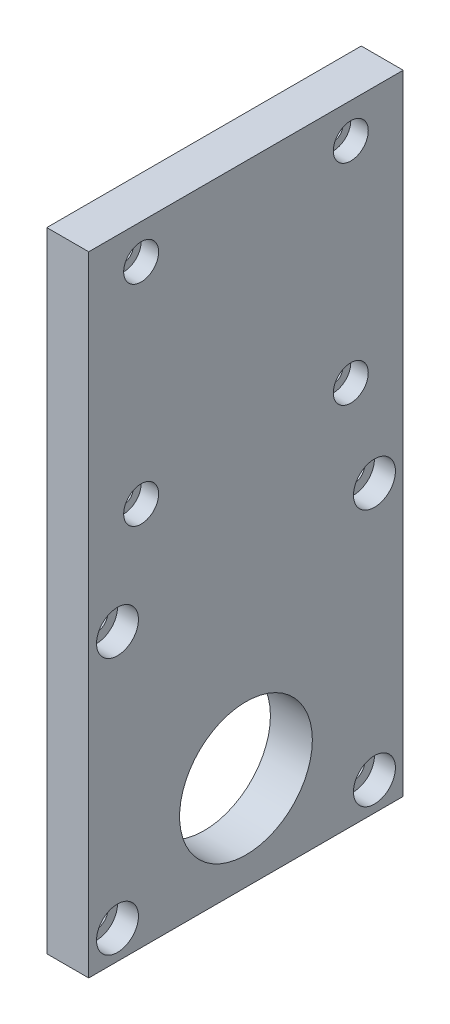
ISO-10303-21;
HEADER;
FILE_DESCRIPTION(('STEP AP214'),'2;1');
FILE_NAME('part.step','',(''),(''),'','','');
FILE_SCHEMA(('AUTOMOTIVE_DESIGN { 1 0 10303 214 1 1 1 1 }'));
ENDSEC;
DATA;
#1=APPLICATION_CONTEXT('core data for automotive mechanical design processes');
#2=APPLICATION_PROTOCOL_DEFINITION('international standard','automotive_design',2000,#1);
#3=PRODUCT_CONTEXT('',#1,'mechanical');
#4=PRODUCT('Part','Part','',(#3));
#5=PRODUCT_RELATED_PRODUCT_CATEGORY('part','',(#4));
#6=PRODUCT_DEFINITION_FORMATION('','',#4);
#7=PRODUCT_DEFINITION_CONTEXT('part definition',#1,'design');
#8=PRODUCT_DEFINITION('design','',#6,#7);
#9=PRODUCT_DEFINITION_SHAPE('','',#8);
#10=(LENGTH_UNIT() NAMED_UNIT(*) SI_UNIT(.MILLI.,.METRE.));
#11=(NAMED_UNIT(*) PLANE_ANGLE_UNIT() SI_UNIT($,.RADIAN.));
#12=(NAMED_UNIT(*) SI_UNIT($,.STERADIAN.) SOLID_ANGLE_UNIT());
#13=UNCERTAINTY_MEASURE_WITH_UNIT(LENGTH_MEASURE(1.E-05),#10,'distance_accuracy_value','');
#14=(GEOMETRIC_REPRESENTATION_CONTEXT(3) GLOBAL_UNCERTAINTY_ASSIGNED_CONTEXT((#13)) GLOBAL_UNIT_ASSIGNED_CONTEXT((#10,
#11,#12)) REPRESENTATION_CONTEXT('',''));
#15=CARTESIAN_POINT('',(0.,0.,0.));
#16=DIRECTION('',(0.,0.,1.));
#17=DIRECTION('',(1.,0.,0.));
#18=AXIS2_PLACEMENT_3D('',#15,#16,#17);
#19=CARTESIAN_POINT('',(7.,80.,-30.));
#20=DIRECTION('',(1.,0.,0.));
#21=DIRECTION('',(0.,0.,-1.));
#22=AXIS2_PLACEMENT_3D('',#19,#20,#21);
#23=CYLINDRICAL_SURFACE('',#22,5.);
#24=CARTESIAN_POINT('',(12.,80.,-30.));
#25=DIRECTION('',(1.,0.,0.));
#26=DIRECTION('',(0.,0.,-1.));
#27=AXIS2_PLACEMENT_3D('',#24,#25,#26);
#28=CIRCLE('',#27,5.);
#29=CARTESIAN_POINT('',(12.,80.,-35.));
#30=VERTEX_POINT('',#29);
#31=EDGE_CURVE('E157',#30,#30,#28,.F.);
#32=ORIENTED_EDGE('',*,*,#31,.F.);
#33=EDGE_LOOP('',(#32));
#34=FACE_BOUND('',#33,.T.);
#35=CARTESIAN_POINT('',(7.,80.,-30.));
#36=DIRECTION('',(1.,0.,0.));
#37=DIRECTION('',(0.,0.,-1.));
#38=AXIS2_PLACEMENT_3D('',#35,#36,#37);
#39=CIRCLE('',#38,5.);
#40=CARTESIAN_POINT('',(7.,80.,-35.));
#41=VERTEX_POINT('',#40);
#42=EDGE_CURVE('E163',#41,#41,#39,.T.);
#43=ORIENTED_EDGE('',*,*,#42,.F.);
#44=EDGE_LOOP('',(#43));
#45=FACE_BOUND('',#44,.T.);
#46=ADVANCED_FACE('F17',(#34,#45),#23,.F.);
#47=CARTESIAN_POINT('',(7.,20.,-30.));
#48=DIRECTION('',(1.,0.,0.));
#49=DIRECTION('',(0.,0.,-1.));
#50=AXIS2_PLACEMENT_3D('',#47,#48,#49);
#51=CYLINDRICAL_SURFACE('',#50,5.);
#52=CARTESIAN_POINT('',(12.,20.,-30.));
#53=DIRECTION('',(1.,0.,0.));
#54=DIRECTION('',(0.,0.,-1.));
#55=AXIS2_PLACEMENT_3D('',#52,#53,#54);
#56=CIRCLE('',#55,5.);
#57=CARTESIAN_POINT('',(12.,20.,-35.));
#58=VERTEX_POINT('',#57);
#59=EDGE_CURVE('E154',#58,#58,#56,.F.);
#60=ORIENTED_EDGE('',*,*,#59,.F.);
#61=EDGE_LOOP('',(#60));
#62=FACE_BOUND('',#61,.T.);
#63=CARTESIAN_POINT('',(7.,20.,-30.));
#64=DIRECTION('',(1.,0.,0.));
#65=DIRECTION('',(0.,0.,-1.));
#66=AXIS2_PLACEMENT_3D('',#63,#64,#65);
#67=CIRCLE('',#66,5.);
#68=CARTESIAN_POINT('',(7.,20.,-35.));
#69=VERTEX_POINT('',#68);
#70=EDGE_CURVE('E169',#69,#69,#67,.T.);
#71=ORIENTED_EDGE('',*,*,#70,.F.);
#72=EDGE_LOOP('',(#71));
#73=FACE_BOUND('',#72,.T.);
#74=ADVANCED_FACE('F319',(#62,#73),#51,.F.);
#75=CARTESIAN_POINT('',(7.,20.,30.));
#76=DIRECTION('',(1.,0.,0.));
#77=DIRECTION('',(0.,0.,-1.));
#78=AXIS2_PLACEMENT_3D('',#75,#76,#77);
#79=CYLINDRICAL_SURFACE('',#78,5.);
#80=CARTESIAN_POINT('',(12.,20.,30.));
#81=DIRECTION('',(1.,0.,0.));
#82=DIRECTION('',(0.,0.,-1.));
#83=AXIS2_PLACEMENT_3D('',#80,#81,#82);
#84=CIRCLE('',#83,5.);
#85=CARTESIAN_POINT('',(12.,20.,25.));
#86=VERTEX_POINT('',#85);
#87=EDGE_CURVE('E151',#86,#86,#84,.F.);
#88=ORIENTED_EDGE('',*,*,#87,.F.);
#89=EDGE_LOOP('',(#88));
#90=FACE_BOUND('',#89,.T.);
#91=CARTESIAN_POINT('',(7.,20.,30.));
#92=DIRECTION('',(1.,0.,0.));
#93=DIRECTION('',(0.,0.,-1.));
#94=AXIS2_PLACEMENT_3D('',#91,#92,#93);
#95=CIRCLE('',#94,5.);
#96=CARTESIAN_POINT('',(7.,20.,25.));
#97=VERTEX_POINT('',#96);
#98=EDGE_CURVE('E166',#97,#97,#95,.T.);
#99=ORIENTED_EDGE('',*,*,#98,.F.);
#100=EDGE_LOOP('',(#99));
#101=FACE_BOUND('',#100,.T.);
#102=ADVANCED_FACE('F325',(#90,#101),#79,.F.);
#103=CARTESIAN_POINT('',(7.,80.,30.));
#104=DIRECTION('',(1.,0.,0.));
#105=DIRECTION('',(0.,0.,-1.));
#106=AXIS2_PLACEMENT_3D('',#103,#104,#105);
#107=CYLINDRICAL_SURFACE('',#106,5.);
#108=CARTESIAN_POINT('',(12.,80.,30.));
#109=DIRECTION('',(1.,0.,0.));
#110=DIRECTION('',(0.,0.,-1.));
#111=AXIS2_PLACEMENT_3D('',#108,#109,#110);
#112=CIRCLE('',#111,5.);
#113=CARTESIAN_POINT('',(12.,80.,25.));
#114=VERTEX_POINT('',#113);
#115=EDGE_CURVE('E148',#114,#114,#112,.F.);
#116=ORIENTED_EDGE('',*,*,#115,.F.);
#117=EDGE_LOOP('',(#116));
#118=FACE_BOUND('',#117,.T.);
#119=CARTESIAN_POINT('',(7.,80.,30.));
#120=DIRECTION('',(1.,0.,0.));
#121=DIRECTION('',(0.,0.,-1.));
#122=AXIS2_PLACEMENT_3D('',#119,#120,#121);
#123=CIRCLE('',#122,5.);
#124=CARTESIAN_POINT('',(7.,80.,25.));
#125=VERTEX_POINT('',#124);
#126=EDGE_CURVE('E160',#125,#125,#123,.T.);
#127=ORIENTED_EDGE('',*,*,#126,.F.);
#128=EDGE_LOOP('',(#127));
#129=FACE_BOUND('',#128,.T.);
#130=ADVANCED_FACE('F200',(#118,#129),#107,.F.);
#131=CARTESIAN_POINT('',(6.,-81.7695526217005,36.7695526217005));
#132=DIRECTION('',(1.,0.,0.));
#133=DIRECTION('',(0.,0.,-1.));
#134=AXIS2_PLACEMENT_3D('',#131,#132,#133);
#135=CYLINDRICAL_SURFACE('',#134,6.);
#136=CARTESIAN_POINT('',(12.,-81.7695526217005,36.7695526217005));
#137=DIRECTION('',(1.,0.,0.));
#138=DIRECTION('',(0.,0.,-1.));
#139=AXIS2_PLACEMENT_3D('',#136,#137,#138);
#140=CIRCLE('',#139,6.);
#141=CARTESIAN_POINT('',(12.,-81.7695526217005,30.7695526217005));
#142=VERTEX_POINT('',#141);
#143=EDGE_CURVE('E145',#142,#142,#140,.F.);
#144=ORIENTED_EDGE('',*,*,#143,.F.);
#145=EDGE_LOOP('',(#144));
#146=FACE_BOUND('',#145,.T.);
#147=CARTESIAN_POINT('',(6.,-81.7695526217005,36.7695526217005));
#148=DIRECTION('',(1.,0.,0.));
#149=DIRECTION('',(0.,0.,-1.));
#150=AXIS2_PLACEMENT_3D('',#147,#148,#149);
#151=CIRCLE('',#150,6.);
#152=CARTESIAN_POINT('',(6.,-81.7695526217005,30.7695526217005));
#153=VERTEX_POINT('',#152);
#154=EDGE_CURVE('E172',#153,#153,#151,.T.);
#155=ORIENTED_EDGE('',*,*,#154,.F.);
#156=EDGE_LOOP('',(#155));
#157=FACE_BOUND('',#156,.T.);
#158=ADVANCED_FACE('F189',(#146,#157),#135,.F.);
#159=CARTESIAN_POINT('',(6.,-81.7695526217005,-36.7695526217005));
#160=DIRECTION('',(1.,0.,0.));
#161=DIRECTION('',(0.,0.,-1.));
#162=AXIS2_PLACEMENT_3D('',#159,#160,#161);
#163=CYLINDRICAL_SURFACE('',#162,6.);
#164=CARTESIAN_POINT('',(12.,-81.7695526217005,-36.7695526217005));
#165=DIRECTION('',(1.,0.,0.));
#166=DIRECTION('',(0.,0.,-1.));
#167=AXIS2_PLACEMENT_3D('',#164,#165,#166);
#168=CIRCLE('',#167,6.);
#169=CARTESIAN_POINT('',(12.,-81.7695526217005,-42.7695526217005));
#170=VERTEX_POINT('',#169);
#171=EDGE_CURVE('E142',#170,#170,#168,.F.);
#172=ORIENTED_EDGE('',*,*,#171,.F.);
#173=EDGE_LOOP('',(#172));
#174=FACE_BOUND('',#173,.T.);
#175=CARTESIAN_POINT('',(6.,-81.7695526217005,-36.7695526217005));
#176=DIRECTION('',(1.,0.,0.));
#177=DIRECTION('',(0.,0.,-1.));
#178=AXIS2_PLACEMENT_3D('',#175,#176,#177);
#179=CIRCLE('',#178,6.);
#180=CARTESIAN_POINT('',(6.,-81.7695526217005,-42.7695526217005));
#181=VERTEX_POINT('',#180);
#182=EDGE_CURVE('E20',#181,#181,#179,.T.);
#183=ORIENTED_EDGE('',*,*,#182,.F.);
#184=EDGE_LOOP('',(#183));
#185=FACE_BOUND('',#184,.T.);
#186=ADVANCED_FACE('F186',(#174,#185),#163,.F.);
#187=CARTESIAN_POINT('',(6.,-8.23044737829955,-36.7695526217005));
#188=DIRECTION('',(1.,0.,0.));
#189=DIRECTION('',(0.,0.,-1.));
#190=AXIS2_PLACEMENT_3D('',#187,#188,#189);
#191=CYLINDRICAL_SURFACE('',#190,5.99999999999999);
#192=CARTESIAN_POINT('',(12.,-8.23044737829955,-36.7695526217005));
#193=DIRECTION('',(1.,0.,0.));
#194=DIRECTION('',(0.,0.,-1.));
#195=AXIS2_PLACEMENT_3D('',#192,#193,#194);
#196=CIRCLE('',#195,5.99999999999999);
#197=CARTESIAN_POINT('',(12.,-8.23044737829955,-42.7695526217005));
#198=VERTEX_POINT('',#197);
#199=EDGE_CURVE('E139',#198,#198,#196,.F.);
#200=ORIENTED_EDGE('',*,*,#199,.F.);
#201=EDGE_LOOP('',(#200));
#202=FACE_BOUND('',#201,.T.);
#203=CARTESIAN_POINT('',(6.,-8.23044737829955,-36.7695526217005));
#204=DIRECTION('',(1.,0.,0.));
#205=DIRECTION('',(0.,0.,-1.));
#206=AXIS2_PLACEMENT_3D('',#203,#204,#205);
#207=CIRCLE('',#206,5.99999999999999);
#208=CARTESIAN_POINT('',(6.,-8.23044737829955,-42.7695526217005));
#209=VERTEX_POINT('',#208);
#210=EDGE_CURVE('E177',#209,#209,#207,.T.);
#211=ORIENTED_EDGE('',*,*,#210,.F.);
#212=EDGE_LOOP('',(#211));
#213=FACE_BOUND('',#212,.T.);
#214=ADVANCED_FACE('F188',(#202,#213),#191,.F.);
#215=CARTESIAN_POINT('',(6.,-8.23044737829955,36.7695526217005));
#216=DIRECTION('',(1.,0.,0.));
#217=DIRECTION('',(0.,0.,-1.));
#218=AXIS2_PLACEMENT_3D('',#215,#216,#217);
#219=CYLINDRICAL_SURFACE('',#218,6.);
#220=CARTESIAN_POINT('',(12.,-8.23044737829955,36.7695526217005));
#221=DIRECTION('',(1.,0.,0.));
#222=DIRECTION('',(0.,0.,-1.));
#223=AXIS2_PLACEMENT_3D('',#220,#221,#222);
#224=CIRCLE('',#223,6.);
#225=CARTESIAN_POINT('',(12.,-8.23044737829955,30.7695526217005));
#226=VERTEX_POINT('',#225);
#227=EDGE_CURVE('E136',#226,#226,#224,.F.);
#228=ORIENTED_EDGE('',*,*,#227,.F.);
#229=EDGE_LOOP('',(#228));
#230=FACE_BOUND('',#229,.T.);
#231=CARTESIAN_POINT('',(6.,-8.23044737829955,36.7695526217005));
#232=DIRECTION('',(1.,0.,0.));
#233=DIRECTION('',(0.,0.,-1.));
#234=AXIS2_PLACEMENT_3D('',#231,#232,#233);
#235=CIRCLE('',#234,6.);
#236=CARTESIAN_POINT('',(6.,-8.23044737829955,30.7695526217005));
#237=VERTEX_POINT('',#236);
#238=EDGE_CURVE('E175',#237,#237,#235,.T.);
#239=ORIENTED_EDGE('',*,*,#238,.F.);
#240=EDGE_LOOP('',(#239));
#241=FACE_BOUND('',#240,.T.);
#242=ADVANCED_FACE('F197',(#230,#241),#219,.F.);
#243=CARTESIAN_POINT('',(6.,-81.7695526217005,-36.7695526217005));
#244=DIRECTION('',(1.,0.,0.));
#245=DIRECTION('',(0.,0.,-1.));
#246=AXIS2_PLACEMENT_3D('',#243,#244,#245);
#247=PLANE('',#246);
#248=CARTESIAN_POINT('',(6.,-81.7695526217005,-36.7695526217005));
#249=DIRECTION('',(1.,0.,0.));
#250=DIRECTION('',(0.,0.,-1.));
#251=AXIS2_PLACEMENT_3D('',#248,#249,#250);
#252=CIRCLE('',#251,3.25);
#253=CARTESIAN_POINT('',(6.,-81.7695526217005,-40.0195526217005));
#254=VERTEX_POINT('',#253);
#255=EDGE_CURVE('E130',#254,#254,#252,.F.);
#256=ORIENTED_EDGE('',*,*,#255,.T.);
#257=EDGE_LOOP('',(#256));
#258=FACE_BOUND('',#257,.T.);
#259=ORIENTED_EDGE('',*,*,#182,.T.);
#260=EDGE_LOOP('',(#259));
#261=FACE_BOUND('',#260,.T.);
#262=ADVANCED_FACE('F184',(#258,#261),#247,.T.);
#263=CARTESIAN_POINT('',(6.,-8.23044737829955,-36.7695526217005));
#264=DIRECTION('',(1.,0.,0.));
#265=DIRECTION('',(0.,0.,-1.));
#266=AXIS2_PLACEMENT_3D('',#263,#264,#265);
#267=PLANE('',#266);
#268=CARTESIAN_POINT('',(6.,-8.23044737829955,-36.7695526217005));
#269=DIRECTION('',(1.,0.,0.));
#270=DIRECTION('',(0.,0.,-1.));
#271=AXIS2_PLACEMENT_3D('',#268,#269,#270);
#272=CIRCLE('',#271,3.25);
#273=CARTESIAN_POINT('',(6.,-8.23044737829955,-40.0195526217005));
#274=VERTEX_POINT('',#273);
#275=EDGE_CURVE('E127',#274,#274,#272,.F.);
#276=ORIENTED_EDGE('',*,*,#275,.T.);
#277=EDGE_LOOP('',(#276));
#278=FACE_BOUND('',#277,.T.);
#279=ORIENTED_EDGE('',*,*,#210,.T.);
#280=EDGE_LOOP('',(#279));
#281=FACE_BOUND('',#280,.T.);
#282=ADVANCED_FACE('F285',(#278,#281),#267,.T.);
#283=CARTESIAN_POINT('',(6.,-8.23044737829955,36.7695526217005));
#284=DIRECTION('',(1.,0.,0.));
#285=DIRECTION('',(0.,0.,-1.));
#286=AXIS2_PLACEMENT_3D('',#283,#284,#285);
#287=PLANE('',#286);
#288=CARTESIAN_POINT('',(6.,-8.23044737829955,36.7695526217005));
#289=DIRECTION('',(1.,0.,0.));
#290=DIRECTION('',(0.,0.,-1.));
#291=AXIS2_PLACEMENT_3D('',#288,#289,#290);
#292=CIRCLE('',#291,3.25);
#293=CARTESIAN_POINT('',(6.,-8.23044737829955,33.5195526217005));
#294=VERTEX_POINT('',#293);
#295=EDGE_CURVE('E124',#294,#294,#292,.F.);
#296=ORIENTED_EDGE('',*,*,#295,.T.);
#297=EDGE_LOOP('',(#296));
#298=FACE_BOUND('',#297,.T.);
#299=ORIENTED_EDGE('',*,*,#238,.T.);
#300=EDGE_LOOP('',(#299));
#301=FACE_BOUND('',#300,.T.);
#302=ADVANCED_FACE('F281',(#298,#301),#287,.T.);
#303=CARTESIAN_POINT('',(6.,-81.7695526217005,36.7695526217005));
#304=DIRECTION('',(1.,0.,0.));
#305=DIRECTION('',(0.,0.,-1.));
#306=AXIS2_PLACEMENT_3D('',#303,#304,#305);
#307=PLANE('',#306);
#308=CARTESIAN_POINT('',(6.,-81.7695526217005,36.7695526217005));
#309=DIRECTION('',(1.,0.,0.));
#310=DIRECTION('',(0.,0.,-1.));
#311=AXIS2_PLACEMENT_3D('',#308,#309,#310);
#312=CIRCLE('',#311,3.25);
#313=CARTESIAN_POINT('',(6.,-81.7695526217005,33.5195526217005));
#314=VERTEX_POINT('',#313);
#315=EDGE_CURVE('E121',#314,#314,#312,.F.);
#316=ORIENTED_EDGE('',*,*,#315,.T.);
#317=EDGE_LOOP('',(#316));
#318=FACE_BOUND('',#317,.T.);
#319=ORIENTED_EDGE('',*,*,#154,.T.);
#320=EDGE_LOOP('',(#319));
#321=FACE_BOUND('',#320,.T.);
#322=ADVANCED_FACE('F277',(#318,#321),#307,.T.);
#323=CARTESIAN_POINT('',(7.,20.,-30.));
#324=DIRECTION('',(1.,0.,0.));
#325=DIRECTION('',(0.,0.,-1.));
#326=AXIS2_PLACEMENT_3D('',#323,#324,#325);
#327=PLANE('',#326);
#328=CARTESIAN_POINT('',(7.,20.,-30.));
#329=DIRECTION('',(1.,0.,0.));
#330=DIRECTION('',(0.,0.,-1.));
#331=AXIS2_PLACEMENT_3D('',#328,#329,#330);
#332=CIRCLE('',#331,2.75);
#333=CARTESIAN_POINT('',(7.,20.,-32.75));
#334=VERTEX_POINT('',#333);
#335=EDGE_CURVE('E118',#334,#334,#332,.F.);
#336=ORIENTED_EDGE('',*,*,#335,.T.);
#337=EDGE_LOOP('',(#336));
#338=FACE_BOUND('',#337,.T.);
#339=ORIENTED_EDGE('',*,*,#70,.T.);
#340=EDGE_LOOP('',(#339));
#341=FACE_BOUND('',#340,.T.);
#342=ADVANCED_FACE('F273',(#338,#341),#327,.T.);
#343=CARTESIAN_POINT('',(7.,20.,30.));
#344=DIRECTION('',(1.,0.,0.));
#345=DIRECTION('',(0.,0.,-1.));
#346=AXIS2_PLACEMENT_3D('',#343,#344,#345);
#347=PLANE('',#346);
#348=CARTESIAN_POINT('',(7.,20.,30.));
#349=DIRECTION('',(1.,0.,0.));
#350=DIRECTION('',(0.,0.,-1.));
#351=AXIS2_PLACEMENT_3D('',#348,#349,#350);
#352=CIRCLE('',#351,2.75);
#353=CARTESIAN_POINT('',(7.,20.,27.25));
#354=VERTEX_POINT('',#353);
#355=EDGE_CURVE('E115',#354,#354,#352,.F.);
#356=ORIENTED_EDGE('',*,*,#355,.T.);
#357=EDGE_LOOP('',(#356));
#358=FACE_BOUND('',#357,.T.);
#359=ORIENTED_EDGE('',*,*,#98,.T.);
#360=EDGE_LOOP('',(#359));
#361=FACE_BOUND('',#360,.T.);
#362=ADVANCED_FACE('F269',(#358,#361),#347,.T.);
#363=CARTESIAN_POINT('',(7.,80.,-30.));
#364=DIRECTION('',(1.,0.,0.));
#365=DIRECTION('',(0.,0.,-1.));
#366=AXIS2_PLACEMENT_3D('',#363,#364,#365);
#367=PLANE('',#366);
#368=CARTESIAN_POINT('',(7.,80.,-30.));
#369=DIRECTION('',(1.,0.,0.));
#370=DIRECTION('',(0.,0.,-1.));
#371=AXIS2_PLACEMENT_3D('',#368,#369,#370);
#372=CIRCLE('',#371,2.75);
#373=CARTESIAN_POINT('',(7.,80.,-32.75));
#374=VERTEX_POINT('',#373);
#375=EDGE_CURVE('E112',#374,#374,#372,.F.);
#376=ORIENTED_EDGE('',*,*,#375,.T.);
#377=EDGE_LOOP('',(#376));
#378=FACE_BOUND('',#377,.T.);
#379=ORIENTED_EDGE('',*,*,#42,.T.);
#380=EDGE_LOOP('',(#379));
#381=FACE_BOUND('',#380,.T.);
#382=ADVANCED_FACE('F265',(#378,#381),#367,.T.);
#383=CARTESIAN_POINT('',(7.,80.,30.));
#384=DIRECTION('',(1.,0.,0.));
#385=DIRECTION('',(0.,0.,-1.));
#386=AXIS2_PLACEMENT_3D('',#383,#384,#385);
#387=PLANE('',#386);
#388=CARTESIAN_POINT('',(7.,80.,30.));
#389=DIRECTION('',(1.,0.,0.));
#390=DIRECTION('',(0.,0.,-1.));
#391=AXIS2_PLACEMENT_3D('',#388,#389,#390);
#392=CIRCLE('',#391,2.75);
#393=CARTESIAN_POINT('',(7.,80.,27.25));
#394=VERTEX_POINT('',#393);
#395=EDGE_CURVE('E67',#394,#394,#392,.F.);
#396=ORIENTED_EDGE('',*,*,#395,.T.);
#397=EDGE_LOOP('',(#396));
#398=FACE_BOUND('',#397,.T.);
#399=ORIENTED_EDGE('',*,*,#126,.T.);
#400=EDGE_LOOP('',(#399));
#401=FACE_BOUND('',#400,.T.);
#402=ADVANCED_FACE('F262',(#398,#401),#387,.T.);
#403=CARTESIAN_POINT('',(12.,0.,0.));
#404=DIRECTION('',(1.,0.,0.));
#405=DIRECTION('',(0.,0.,-1.));
#406=AXIS2_PLACEMENT_3D('',#403,#404,#405);
#407=PLANE('',#406);
#408=DIRECTION('',(0.,1.,0.));
#409=VECTOR('',#408,1.);
#410=CARTESIAN_POINT('',(12.,90.,45.));
#411=LINE('',#410,#409);
#412=CARTESIAN_POINT('',(12.,90.,45.));
#413=VERTEX_POINT('',#412);
#414=CARTESIAN_POINT('',(12.,-90.,45.));
#415=VERTEX_POINT('',#414);
#416=EDGE_CURVE('E55',#413,#415,#411,.F.);
#417=ORIENTED_EDGE('',*,*,#416,.T.);
#418=DIRECTION('',(0.,0.,1.));
#419=VECTOR('',#418,1.);
#420=CARTESIAN_POINT('',(12.,-90.,45.));
#421=LINE('',#420,#419);
#422=CARTESIAN_POINT('',(12.,-90.,-45.));
#423=VERTEX_POINT('',#422);
#424=EDGE_CURVE('E566',#415,#423,#421,.F.);
#425=ORIENTED_EDGE('',*,*,#424,.T.);
#426=DIRECTION('',(0.,-1.,0.));
#427=VECTOR('',#426,1.);
#428=CARTESIAN_POINT('',(12.,90.,-45.));
#429=LINE('',#428,#427);
#430=CARTESIAN_POINT('',(12.,90.,-45.));
#431=VERTEX_POINT('',#430);
#432=EDGE_CURVE('E61',#423,#431,#429,.F.);
#433=ORIENTED_EDGE('',*,*,#432,.T.);
#434=DIRECTION('',(0.,0.,-1.));
#435=VECTOR('',#434,1.);
#436=CARTESIAN_POINT('',(12.,90.,45.));
#437=LINE('',#436,#435);
#438=EDGE_CURVE('E58',#431,#413,#437,.F.);
#439=ORIENTED_EDGE('',*,*,#438,.T.);
#440=EDGE_LOOP('',(#417,#425,#433,#439));
#441=FACE_BOUND('',#440,.T.);
#442=ORIENTED_EDGE('',*,*,#227,.T.);
#443=EDGE_LOOP('',(#442));
#444=FACE_BOUND('',#443,.T.);
#445=ORIENTED_EDGE('',*,*,#199,.T.);
#446=EDGE_LOOP('',(#445));
#447=FACE_BOUND('',#446,.T.);
#448=ORIENTED_EDGE('',*,*,#171,.T.);
#449=EDGE_LOOP('',(#448));
#450=FACE_BOUND('',#449,.T.);
#451=ORIENTED_EDGE('',*,*,#143,.T.);
#452=EDGE_LOOP('',(#451));
#453=FACE_BOUND('',#452,.T.);
#454=CARTESIAN_POINT('',(12.,-63.,0.));
#455=DIRECTION('',(1.,0.,0.));
#456=DIRECTION('',(0.,0.,-1.));
#457=AXIS2_PLACEMENT_3D('',#454,#455,#456);
#458=CIRCLE('',#457,19.);
#459=CARTESIAN_POINT('',(12.,-63.,-19.));
#460=VERTEX_POINT('',#459);
#461=EDGE_CURVE('E133',#460,#460,#458,.F.);
#462=ORIENTED_EDGE('',*,*,#461,.T.);
#463=EDGE_LOOP('',(#462));
#464=FACE_BOUND('',#463,.T.);
#465=ORIENTED_EDGE('',*,*,#115,.T.);
#466=EDGE_LOOP('',(#465));
#467=FACE_BOUND('',#466,.T.);
#468=ORIENTED_EDGE('',*,*,#87,.T.);
#469=EDGE_LOOP('',(#468));
#470=FACE_BOUND('',#469,.T.);
#471=ORIENTED_EDGE('',*,*,#59,.T.);
#472=EDGE_LOOP('',(#471));
#473=FACE_BOUND('',#472,.T.);
#474=ORIENTED_EDGE('',*,*,#31,.T.);
#475=EDGE_LOOP('',(#474));
#476=FACE_BOUND('',#475,.T.);
#477=ADVANCED_FACE('F59',(#441,#444,#447,#450,#453,#464,#467,#470,#473,#476),#407,.T.);
#478=CARTESIAN_POINT('',(0.,-63.,0.));
#479=DIRECTION('',(1.,0.,0.));
#480=DIRECTION('',(0.,0.,-1.));
#481=AXIS2_PLACEMENT_3D('',#478,#479,#480);
#482=CYLINDRICAL_SURFACE('',#481,19.);
#483=CARTESIAN_POINT('',(0.,-63.,0.));
#484=DIRECTION('',(1.,0.,0.));
#485=DIRECTION('',(0.,0.,-1.));
#486=AXIS2_PLACEMENT_3D('',#483,#484,#485);
#487=CIRCLE('',#486,19.);
#488=CARTESIAN_POINT('',(0.,-63.,-19.));
#489=VERTEX_POINT('',#488);
#490=EDGE_CURVE('E106',#489,#489,#487,.F.);
#491=ORIENTED_EDGE('',*,*,#490,.T.);
#492=EDGE_LOOP('',(#491));
#493=FACE_BOUND('',#492,.T.);
#494=ORIENTED_EDGE('',*,*,#461,.F.);
#495=EDGE_LOOP('',(#494));
#496=FACE_BOUND('',#495,.T.);
#497=ADVANCED_FACE('F255',(#493,#496),#482,.F.);
#498=CARTESIAN_POINT('',(0.,-81.7695526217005,-36.7695526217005));
#499=DIRECTION('',(1.,0.,0.));
#500=DIRECTION('',(0.,0.,-1.));
#501=AXIS2_PLACEMENT_3D('',#498,#499,#500);
#502=CYLINDRICAL_SURFACE('',#501,3.25);
#503=CARTESIAN_POINT('',(0.,-81.7695526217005,-36.7695526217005));
#504=DIRECTION('',(1.,0.,0.));
#505=DIRECTION('',(0.,0.,-1.));
#506=AXIS2_PLACEMENT_3D('',#503,#504,#505);
#507=CIRCLE('',#506,3.25);
#508=CARTESIAN_POINT('',(0.,-81.7695526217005,-40.0195526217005));
#509=VERTEX_POINT('',#508);
#510=EDGE_CURVE('E103',#509,#509,#507,.F.);
#511=ORIENTED_EDGE('',*,*,#510,.T.);
#512=EDGE_LOOP('',(#511));
#513=FACE_BOUND('',#512,.T.);
#514=ORIENTED_EDGE('',*,*,#255,.F.);
#515=EDGE_LOOP('',(#514));
#516=FACE_BOUND('',#515,.T.);
#517=ADVANCED_FACE('F251',(#513,#516),#502,.F.);
#518=CARTESIAN_POINT('',(0.,-8.23044737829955,-36.7695526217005));
#519=DIRECTION('',(1.,0.,0.));
#520=DIRECTION('',(0.,0.,-1.));
#521=AXIS2_PLACEMENT_3D('',#518,#519,#520);
#522=CYLINDRICAL_SURFACE('',#521,3.25);
#523=CARTESIAN_POINT('',(0.,-8.23044737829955,-36.7695526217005));
#524=DIRECTION('',(1.,0.,0.));
#525=DIRECTION('',(0.,0.,-1.));
#526=AXIS2_PLACEMENT_3D('',#523,#524,#525);
#527=CIRCLE('',#526,3.25);
#528=CARTESIAN_POINT('',(0.,-8.23044737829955,-40.0195526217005));
#529=VERTEX_POINT('',#528);
#530=EDGE_CURVE('E100',#529,#529,#527,.F.);
#531=ORIENTED_EDGE('',*,*,#530,.T.);
#532=EDGE_LOOP('',(#531));
#533=FACE_BOUND('',#532,.T.);
#534=ORIENTED_EDGE('',*,*,#275,.F.);
#535=EDGE_LOOP('',(#534));
#536=FACE_BOUND('',#535,.T.);
#537=ADVANCED_FACE('F247',(#533,#536),#522,.F.);
#538=CARTESIAN_POINT('',(0.,-8.23044737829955,36.7695526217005));
#539=DIRECTION('',(1.,0.,0.));
#540=DIRECTION('',(0.,0.,-1.));
#541=AXIS2_PLACEMENT_3D('',#538,#539,#540);
#542=CYLINDRICAL_SURFACE('',#541,3.25);
#543=CARTESIAN_POINT('',(0.,-8.23044737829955,36.7695526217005));
#544=DIRECTION('',(1.,0.,0.));
#545=DIRECTION('',(0.,0.,-1.));
#546=AXIS2_PLACEMENT_3D('',#543,#544,#545);
#547=CIRCLE('',#546,3.25);
#548=CARTESIAN_POINT('',(0.,-8.23044737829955,33.5195526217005));
#549=VERTEX_POINT('',#548);
#550=EDGE_CURVE('E97',#549,#549,#547,.F.);
#551=ORIENTED_EDGE('',*,*,#550,.T.);
#552=EDGE_LOOP('',(#551));
#553=FACE_BOUND('',#552,.T.);
#554=ORIENTED_EDGE('',*,*,#295,.F.);
#555=EDGE_LOOP('',(#554));
#556=FACE_BOUND('',#555,.T.);
#557=ADVANCED_FACE('F243',(#553,#556),#542,.F.);
#558=CARTESIAN_POINT('',(0.,-81.7695526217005,36.7695526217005));
#559=DIRECTION('',(1.,0.,0.));
#560=DIRECTION('',(0.,0.,-1.));
#561=AXIS2_PLACEMENT_3D('',#558,#559,#560);
#562=CYLINDRICAL_SURFACE('',#561,3.25);
#563=CARTESIAN_POINT('',(0.,-81.7695526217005,36.7695526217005));
#564=DIRECTION('',(1.,0.,0.));
#565=DIRECTION('',(0.,0.,-1.));
#566=AXIS2_PLACEMENT_3D('',#563,#564,#565);
#567=CIRCLE('',#566,3.25);
#568=CARTESIAN_POINT('',(0.,-81.7695526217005,33.5195526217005));
#569=VERTEX_POINT('',#568);
#570=EDGE_CURVE('E94',#569,#569,#567,.F.);
#571=ORIENTED_EDGE('',*,*,#570,.T.);
#572=EDGE_LOOP('',(#571));
#573=FACE_BOUND('',#572,.T.);
#574=ORIENTED_EDGE('',*,*,#315,.F.);
#575=EDGE_LOOP('',(#574));
#576=FACE_BOUND('',#575,.T.);
#577=ADVANCED_FACE('F239',(#573,#576),#562,.F.);
#578=CARTESIAN_POINT('',(0.,20.,-30.));
#579=DIRECTION('',(1.,0.,0.));
#580=DIRECTION('',(0.,0.,-1.));
#581=AXIS2_PLACEMENT_3D('',#578,#579,#580);
#582=CYLINDRICAL_SURFACE('',#581,2.75);
#583=CARTESIAN_POINT('',(0.,20.,-30.));
#584=DIRECTION('',(1.,0.,0.));
#585=DIRECTION('',(0.,0.,-1.));
#586=AXIS2_PLACEMENT_3D('',#583,#584,#585);
#587=CIRCLE('',#586,2.75);
#588=CARTESIAN_POINT('',(0.,20.,-32.75));
#589=VERTEX_POINT('',#588);
#590=EDGE_CURVE('E91',#589,#589,#587,.F.);
#591=ORIENTED_EDGE('',*,*,#590,.T.);
#592=EDGE_LOOP('',(#591));
#593=FACE_BOUND('',#592,.T.);
#594=ORIENTED_EDGE('',*,*,#335,.F.);
#595=EDGE_LOOP('',(#594));
#596=FACE_BOUND('',#595,.T.);
#597=ADVANCED_FACE('F235',(#593,#596),#582,.F.);
#598=CARTESIAN_POINT('',(0.,20.,30.));
#599=DIRECTION('',(1.,0.,0.));
#600=DIRECTION('',(0.,0.,-1.));
#601=AXIS2_PLACEMENT_3D('',#598,#599,#600);
#602=CYLINDRICAL_SURFACE('',#601,2.75);
#603=CARTESIAN_POINT('',(0.,20.,30.));
#604=DIRECTION('',(1.,0.,0.));
#605=DIRECTION('',(0.,0.,-1.));
#606=AXIS2_PLACEMENT_3D('',#603,#604,#605);
#607=CIRCLE('',#606,2.75);
#608=CARTESIAN_POINT('',(0.,20.,27.25));
#609=VERTEX_POINT('',#608);
#610=EDGE_CURVE('E88',#609,#609,#607,.F.);
#611=ORIENTED_EDGE('',*,*,#610,.T.);
#612=EDGE_LOOP('',(#611));
#613=FACE_BOUND('',#612,.T.);
#614=ORIENTED_EDGE('',*,*,#355,.F.);
#615=EDGE_LOOP('',(#614));
#616=FACE_BOUND('',#615,.T.);
#617=ADVANCED_FACE('F231',(#613,#616),#602,.F.);
#618=CARTESIAN_POINT('',(0.,80.,-30.));
#619=DIRECTION('',(1.,0.,0.));
#620=DIRECTION('',(0.,0.,-1.));
#621=AXIS2_PLACEMENT_3D('',#618,#619,#620);
#622=CYLINDRICAL_SURFACE('',#621,2.75);
#623=CARTESIAN_POINT('',(0.,80.,-30.));
#624=DIRECTION('',(1.,0.,0.));
#625=DIRECTION('',(0.,0.,-1.));
#626=AXIS2_PLACEMENT_3D('',#623,#624,#625);
#627=CIRCLE('',#626,2.75);
#628=CARTESIAN_POINT('',(0.,80.,-32.75));
#629=VERTEX_POINT('',#628);
#630=EDGE_CURVE('E85',#629,#629,#627,.F.);
#631=ORIENTED_EDGE('',*,*,#630,.T.);
#632=EDGE_LOOP('',(#631));
#633=FACE_BOUND('',#632,.T.);
#634=ORIENTED_EDGE('',*,*,#375,.F.);
#635=EDGE_LOOP('',(#634));
#636=FACE_BOUND('',#635,.T.);
#637=ADVANCED_FACE('F227',(#633,#636),#622,.F.);
#638=CARTESIAN_POINT('',(0.,80.,30.));
#639=DIRECTION('',(1.,0.,0.));
#640=DIRECTION('',(0.,0.,-1.));
#641=AXIS2_PLACEMENT_3D('',#638,#639,#640);
#642=CYLINDRICAL_SURFACE('',#641,2.75);
#643=CARTESIAN_POINT('',(0.,80.,30.));
#644=DIRECTION('',(1.,0.,0.));
#645=DIRECTION('',(0.,0.,-1.));
#646=AXIS2_PLACEMENT_3D('',#643,#644,#645);
#647=CIRCLE('',#646,2.75);
#648=CARTESIAN_POINT('',(0.,80.,27.25));
#649=VERTEX_POINT('',#648);
#650=EDGE_CURVE('E82',#649,#649,#647,.F.);
#651=ORIENTED_EDGE('',*,*,#650,.T.);
#652=EDGE_LOOP('',(#651));
#653=FACE_BOUND('',#652,.T.);
#654=ORIENTED_EDGE('',*,*,#395,.F.);
#655=EDGE_LOOP('',(#654));
#656=FACE_BOUND('',#655,.T.);
#657=ADVANCED_FACE('F224',(#653,#656),#642,.F.);
#658=CARTESIAN_POINT('',(12.,90.,45.));
#659=DIRECTION('',(0.,-1.,0.));
#660=DIRECTION('',(0.,0.,-1.));
#661=AXIS2_PLACEMENT_3D('',#658,#659,#660);
#662=PLANE('',#661);
#663=DIRECTION('',(1.,0.,0.));
#664=VECTOR('',#663,1.);
#665=CARTESIAN_POINT('',(12.,90.,45.));
#666=LINE('',#665,#664);
#667=CARTESIAN_POINT('',(0.,90.,45.));
#668=VERTEX_POINT('',#667);
#669=EDGE_CURVE('E66',#668,#413,#666,.T.);
#670=ORIENTED_EDGE('',*,*,#669,.T.);
#671=ORIENTED_EDGE('',*,*,#438,.F.);
#672=DIRECTION('',(1.,0.,0.));
#673=VECTOR('',#672,1.);
#674=CARTESIAN_POINT('',(12.,90.,-45.));
#675=LINE('',#674,#673);
#676=CARTESIAN_POINT('',(0.,90.,-45.));
#677=VERTEX_POINT('',#676);
#678=EDGE_CURVE('E109',#431,#677,#675,.F.);
#679=ORIENTED_EDGE('',*,*,#678,.T.);
#680=DIRECTION('',(0.,0.,-1.));
#681=VECTOR('',#680,1.);
#682=CARTESIAN_POINT('',(0.,90.,0.));
#683=LINE('',#682,#681);
#684=EDGE_CURVE('E78',#677,#668,#683,.F.);
#685=ORIENTED_EDGE('',*,*,#684,.T.);
#686=EDGE_LOOP('',(#670,#671,#679,#685));
#687=FACE_BOUND('',#686,.T.);
#688=ADVANCED_FACE('F77',(#687),#662,.F.);
#689=CARTESIAN_POINT('',(12.,90.,45.));
#690=DIRECTION('',(0.,0.,-1.));
#691=DIRECTION('',(0.,1.,0.));
#692=AXIS2_PLACEMENT_3D('',#689,#690,#691);
#693=PLANE('',#692);
#694=DIRECTION('',(1.,0.,0.));
#695=VECTOR('',#694,1.);
#696=CARTESIAN_POINT('',(12.,-90.,45.));
#697=LINE('',#696,#695);
#698=CARTESIAN_POINT('',(0.,-90.,45.));
#699=VERTEX_POINT('',#698);
#700=EDGE_CURVE('E74',#699,#415,#697,.T.);
#701=ORIENTED_EDGE('',*,*,#700,.T.);
#702=ORIENTED_EDGE('',*,*,#416,.F.);
#703=ORIENTED_EDGE('',*,*,#669,.F.);
#704=DIRECTION('',(0.,1.,0.));
#705=VECTOR('',#704,1.);
#706=CARTESIAN_POINT('',(0.,0.,45.));
#707=LINE('',#706,#705);
#708=EDGE_CURVE('E573',#668,#699,#707,.F.);
#709=ORIENTED_EDGE('',*,*,#708,.T.);
#710=EDGE_LOOP('',(#701,#702,#703,#709));
#711=FACE_BOUND('',#710,.T.);
#712=ADVANCED_FACE('F71',(#711),#693,.F.);
#713=CARTESIAN_POINT('',(12.,-90.,45.));
#714=DIRECTION('',(0.,1.,0.));
#715=DIRECTION('',(0.,0.,1.));
#716=AXIS2_PLACEMENT_3D('',#713,#714,#715);
#717=PLANE('',#716);
#718=DIRECTION('',(1.,0.,0.));
#719=VECTOR('',#718,1.);
#720=CARTESIAN_POINT('',(12.,-90.,-45.));
#721=LINE('',#720,#719);
#722=CARTESIAN_POINT('',(0.,-90.,-45.));
#723=VERTEX_POINT('',#722);
#724=EDGE_CURVE('E34',#723,#423,#721,.T.);
#725=ORIENTED_EDGE('',*,*,#724,.T.);
#726=ORIENTED_EDGE('',*,*,#424,.F.);
#727=ORIENTED_EDGE('',*,*,#700,.F.);
#728=DIRECTION('',(0.,0.,-1.));
#729=VECTOR('',#728,1.);
#730=CARTESIAN_POINT('',(0.,-90.,0.));
#731=LINE('',#730,#729);
#732=EDGE_CURVE('E26',#699,#723,#731,.T.);
#733=ORIENTED_EDGE('',*,*,#732,.T.);
#734=EDGE_LOOP('',(#725,#726,#727,#733));
#735=FACE_BOUND('',#734,.T.);
#736=ADVANCED_FACE('F212',(#735),#717,.F.);
#737=CARTESIAN_POINT('',(12.,90.,-45.));
#738=DIRECTION('',(0.,0.,1.));
#739=DIRECTION('',(0.,-1.,0.));
#740=AXIS2_PLACEMENT_3D('',#737,#738,#739);
#741=PLANE('',#740);
#742=ORIENTED_EDGE('',*,*,#678,.F.);
#743=ORIENTED_EDGE('',*,*,#432,.F.);
#744=ORIENTED_EDGE('',*,*,#724,.F.);
#745=DIRECTION('',(0.,1.,0.));
#746=VECTOR('',#745,1.);
#747=CARTESIAN_POINT('',(0.,0.,-45.));
#748=LINE('',#747,#746);
#749=EDGE_CURVE('E11',#723,#677,#748,.T.);
#750=ORIENTED_EDGE('',*,*,#749,.T.);
#751=EDGE_LOOP('',(#742,#743,#744,#750));
#752=FACE_BOUND('',#751,.T.);
#753=ADVANCED_FACE('F206',(#752),#741,.F.);
#754=CARTESIAN_POINT('',(0.,0.,0.));
#755=DIRECTION('',(1.,0.,0.));
#756=DIRECTION('',(0.,0.,-1.));
#757=AXIS2_PLACEMENT_3D('',#754,#755,#756);
#758=PLANE('',#757);
#759=ORIENTED_EDGE('',*,*,#732,.F.);
#760=ORIENTED_EDGE('',*,*,#708,.F.);
#761=ORIENTED_EDGE('',*,*,#684,.F.);
#762=ORIENTED_EDGE('',*,*,#749,.F.);
#763=EDGE_LOOP('',(#759,#760,#761,#762));
#764=FACE_BOUND('',#763,.T.);
#765=ORIENTED_EDGE('',*,*,#650,.F.);
#766=EDGE_LOOP('',(#765));
#767=FACE_BOUND('',#766,.T.);
#768=ORIENTED_EDGE('',*,*,#630,.F.);
#769=EDGE_LOOP('',(#768));
#770=FACE_BOUND('',#769,.T.);
#771=ORIENTED_EDGE('',*,*,#610,.F.);
#772=EDGE_LOOP('',(#771));
#773=FACE_BOUND('',#772,.T.);
#774=ORIENTED_EDGE('',*,*,#590,.F.);
#775=EDGE_LOOP('',(#774));
#776=FACE_BOUND('',#775,.T.);
#777=ORIENTED_EDGE('',*,*,#570,.F.);
#778=EDGE_LOOP('',(#777));
#779=FACE_BOUND('',#778,.T.);
#780=ORIENTED_EDGE('',*,*,#550,.F.);
#781=EDGE_LOOP('',(#780));
#782=FACE_BOUND('',#781,.T.);
#783=ORIENTED_EDGE('',*,*,#530,.F.);
#784=EDGE_LOOP('',(#783));
#785=FACE_BOUND('',#784,.T.);
#786=ORIENTED_EDGE('',*,*,#510,.F.);
#787=EDGE_LOOP('',(#786));
#788=FACE_BOUND('',#787,.T.);
#789=ORIENTED_EDGE('',*,*,#490,.F.);
#790=EDGE_LOOP('',(#789));
#791=FACE_BOUND('',#790,.T.);
#792=ADVANCED_FACE('F204',(#764,#767,#770,#773,#776,#779,#782,#785,#788,#791),#758,.F.);
#793=CLOSED_SHELL('',(#46,#74,#102,#130,#158,#186,#214,#242,#262,#282,#302,#322,#342,#362,#382,
#402,#477,#497,#517,#537,#557,#577,#597,#617,#637,#657,#688,#712,#736,#753,#792));
#794=MANIFOLD_SOLID_BREP('B1',#793);
#795=ADVANCED_BREP_SHAPE_REPRESENTATION('',(#18,#794),#14);
#796=SHAPE_DEFINITION_REPRESENTATION(#9,#795);
ENDSEC;
END-ISO-10303-21;
